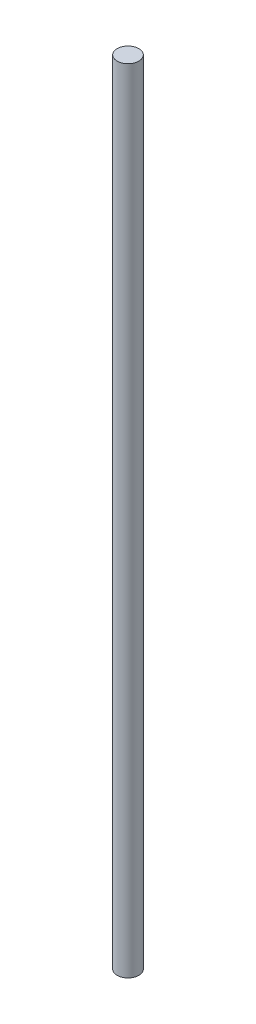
from build123d import *

# Parameters (mm, degrees)
SKETCH1_R           = 4
BOSS_EXTRUDE1_DEPTH = 292.1


with BuildPart() as part:
    # Sketch1 → Boss-Extrude1 (new body)
    with BuildSketch(Plane(origin=(0, 0, 0), x_dir=(1, 0, 0), z_dir=(0, 1, 0))):
        with Locations(Location((0, 0, 0), (0, 0, 270))):
            Circle(SKETCH1_R)
    extrude(amount=BOSS_EXTRUDE1_DEPTH)


solid = part.part
